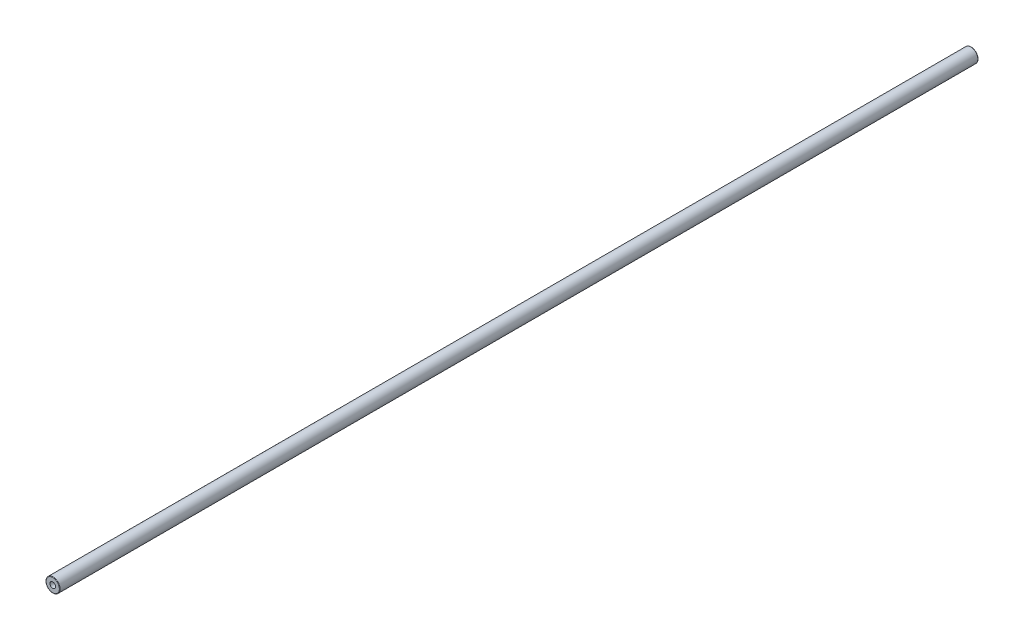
ISO-10303-21;
HEADER;
FILE_DESCRIPTION(('STEP AP214'),'2;1');
FILE_NAME('part.step','',(''),(''),'','','');
FILE_SCHEMA(('AUTOMOTIVE_DESIGN { 1 0 10303 214 1 1 1 1 }'));
ENDSEC;
DATA;
#1=APPLICATION_CONTEXT('core data for automotive mechanical design processes');
#2=APPLICATION_PROTOCOL_DEFINITION('international standard','automotive_design',2000,#1);
#3=PRODUCT_CONTEXT('',#1,'mechanical');
#4=PRODUCT('Part','Part','',(#3));
#5=PRODUCT_RELATED_PRODUCT_CATEGORY('part','',(#4));
#6=PRODUCT_DEFINITION_FORMATION('','',#4);
#7=PRODUCT_DEFINITION_CONTEXT('part definition',#1,'design');
#8=PRODUCT_DEFINITION('design','',#6,#7);
#9=PRODUCT_DEFINITION_SHAPE('','',#8);
#10=(LENGTH_UNIT() NAMED_UNIT(*) SI_UNIT(.MILLI.,.METRE.));
#11=(NAMED_UNIT(*) PLANE_ANGLE_UNIT() SI_UNIT($,.RADIAN.));
#12=(NAMED_UNIT(*) SI_UNIT($,.STERADIAN.) SOLID_ANGLE_UNIT());
#13=UNCERTAINTY_MEASURE_WITH_UNIT(LENGTH_MEASURE(1.E-05),#10,'distance_accuracy_value','');
#14=(GEOMETRIC_REPRESENTATION_CONTEXT(3) GLOBAL_UNCERTAINTY_ASSIGNED_CONTEXT((#13)) GLOBAL_UNIT_ASSIGNED_CONTEXT((#10,
#11,#12)) REPRESENTATION_CONTEXT('',''));
#15=CARTESIAN_POINT('',(0.,0.,0.));
#16=DIRECTION('',(0.,0.,1.));
#17=DIRECTION('',(1.,0.,0.));
#18=AXIS2_PLACEMENT_3D('',#15,#16,#17);
#19=CARTESIAN_POINT('',(0.,0.,1041.4));
#20=DIRECTION('',(0.,0.,1.));
#21=DIRECTION('',(1.,0.,0.));
#22=AXIS2_PLACEMENT_3D('',#19,#20,#21);
#23=PLANE('',#22);
#24=CARTESIAN_POINT('',(0.,0.,1041.4));
#25=DIRECTION('',(0.,0.,1.));
#26=DIRECTION('',(1.,0.,0.));
#27=AXIS2_PLACEMENT_3D('',#24,#25,#26);
#28=CIRCLE('',#27,7.4295);
#29=CARTESIAN_POINT('',(7.4295,0.,1041.4));
#30=VERTEX_POINT('',#29);
#31=EDGE_CURVE('E10',#30,#30,#28,.T.);
#32=ORIENTED_EDGE('',*,*,#31,.T.);
#33=EDGE_LOOP('',(#32));
#34=FACE_BOUND('',#33,.T.);
#35=CARTESIAN_POINT('',(0.,0.,1041.4));
#36=DIRECTION('',(0.,0.,1.));
#37=DIRECTION('',(1.,0.,0.));
#38=AXIS2_PLACEMENT_3D('',#35,#36,#37);
#39=CIRCLE('',#38,3.175);
#40=CARTESIAN_POINT('',(3.175,0.,1041.4));
#41=VERTEX_POINT('',#40);
#42=EDGE_CURVE('E51',#41,#41,#39,.T.);
#43=ORIENTED_EDGE('',*,*,#42,.F.);
#44=EDGE_LOOP('',(#43));
#45=FACE_BOUND('',#44,.T.);
#46=ADVANCED_FACE('F31',(#34,#45),#23,.T.);
#47=CARTESIAN_POINT('',(0.,0.,0.));
#48=DIRECTION('',(0.,0.,1.));
#49=DIRECTION('',(1.,0.,0.));
#50=AXIS2_PLACEMENT_3D('',#47,#48,#49);
#51=PLANE('',#50);
#52=CARTESIAN_POINT('',(0.,0.,0.));
#53=DIRECTION('',(0.,0.,1.));
#54=DIRECTION('',(1.,0.,0.));
#55=AXIS2_PLACEMENT_3D('',#52,#53,#54);
#56=CIRCLE('',#55,7.4295);
#57=CARTESIAN_POINT('',(7.4295,0.,0.));
#58=VERTEX_POINT('',#57);
#59=EDGE_CURVE('E38',#58,#58,#56,.F.);
#60=ORIENTED_EDGE('',*,*,#59,.T.);
#61=EDGE_LOOP('',(#60));
#62=FACE_BOUND('',#61,.T.);
#63=CARTESIAN_POINT('',(0.,0.,0.));
#64=DIRECTION('',(0.,0.,1.));
#65=DIRECTION('',(1.,0.,0.));
#66=AXIS2_PLACEMENT_3D('',#63,#64,#65);
#67=CIRCLE('',#66,3.175);
#68=CARTESIAN_POINT('',(3.175,0.,0.));
#69=VERTEX_POINT('',#68);
#70=EDGE_CURVE('E52',#69,#69,#67,.T.);
#71=ORIENTED_EDGE('',*,*,#70,.T.);
#72=EDGE_LOOP('',(#71));
#73=FACE_BOUND('',#72,.T.);
#74=ADVANCED_FACE('F62',(#62,#73),#51,.F.);
#75=CARTESIAN_POINT('',(0.,0.,1041.4));
#76=DIRECTION('',(0.,0.,-1.));
#77=DIRECTION('',(-1.,0.,0.));
#78=AXIS2_PLACEMENT_3D('',#75,#76,#77);
#79=CYLINDRICAL_SURFACE('',#78,7.9375);
#80=CARTESIAN_POINT('',(0.,0.,0.507999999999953));
#81=DIRECTION('',(0.,0.,1.));
#82=DIRECTION('',(1.,0.,0.));
#83=AXIS2_PLACEMENT_3D('',#80,#81,#82);
#84=CIRCLE('',#83,7.9375);
#85=CARTESIAN_POINT('',(7.9375,0.,0.507999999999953));
#86=VERTEX_POINT('',#85);
#87=EDGE_CURVE('E42',#86,#86,#84,.T.);
#88=ORIENTED_EDGE('',*,*,#87,.T.);
#89=EDGE_LOOP('',(#88));
#90=FACE_BOUND('',#89,.T.);
#91=CARTESIAN_POINT('',(0.,0.,1040.892));
#92=DIRECTION('',(0.,0.,1.));
#93=DIRECTION('',(1.,0.,0.));
#94=AXIS2_PLACEMENT_3D('',#91,#92,#93);
#95=CIRCLE('',#94,7.9375);
#96=CARTESIAN_POINT('',(7.9375,0.,1040.892));
#97=VERTEX_POINT('',#96);
#98=EDGE_CURVE('E46',#97,#97,#95,.F.);
#99=ORIENTED_EDGE('',*,*,#98,.T.);
#100=EDGE_LOOP('',(#99));
#101=FACE_BOUND('',#100,.T.);
#102=ADVANCED_FACE('F67',(#90,#101),#79,.T.);
#103=CARTESIAN_POINT('',(0.,0.,1041.4));
#104=DIRECTION('',(0.,0.,-1.));
#105=DIRECTION('',(-1.,0.,0.));
#106=AXIS2_PLACEMENT_3D('',#103,#104,#105);
#107=CYLINDRICAL_SURFACE('',#106,3.175);
#108=ORIENTED_EDGE('',*,*,#42,.T.);
#109=EDGE_LOOP('',(#108));
#110=FACE_BOUND('',#109,.T.);
#111=ORIENTED_EDGE('',*,*,#70,.F.);
#112=EDGE_LOOP('',(#111));
#113=FACE_BOUND('',#112,.T.);
#114=ADVANCED_FACE('F58',(#110,#113),#107,.F.);
#115=CARTESIAN_POINT('',(0.,0.,0.507999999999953));
#116=DIRECTION('',(0.,0.,1.));
#117=DIRECTION('',(1.,0.,0.));
#118=AXIS2_PLACEMENT_3D('',#115,#116,#117);
#119=TOROIDAL_SURFACE('',#118,7.4295,0.508);
#120=ORIENTED_EDGE('',*,*,#59,.F.);
#121=EDGE_LOOP('',(#120));
#122=FACE_BOUND('',#121,.T.);
#123=ORIENTED_EDGE('',*,*,#87,.F.);
#124=EDGE_LOOP('',(#123));
#125=FACE_BOUND('',#124,.T.);
#126=ADVANCED_FACE('F73',(#122,#125),#119,.T.);
#127=CARTESIAN_POINT('',(0.,0.,1040.892));
#128=DIRECTION('',(0.,0.,1.));
#129=DIRECTION('',(1.,0.,0.));
#130=AXIS2_PLACEMENT_3D('',#127,#128,#129);
#131=TOROIDAL_SURFACE('',#130,7.4295,0.508);
#132=ORIENTED_EDGE('',*,*,#98,.F.);
#133=EDGE_LOOP('',(#132));
#134=FACE_BOUND('',#133,.T.);
#135=ORIENTED_EDGE('',*,*,#31,.F.);
#136=EDGE_LOOP('',(#135));
#137=FACE_BOUND('',#136,.T.);
#138=ADVANCED_FACE('F33',(#134,#137),#131,.T.);
#139=CLOSED_SHELL('',(#46,#74,#102,#114,#126,#138));
#140=MANIFOLD_SOLID_BREP('B2',#139);
#141=ADVANCED_BREP_SHAPE_REPRESENTATION('',(#18,#140),#14);
#142=SHAPE_DEFINITION_REPRESENTATION(#9,#141);
ENDSEC;
END-ISO-10303-21;
